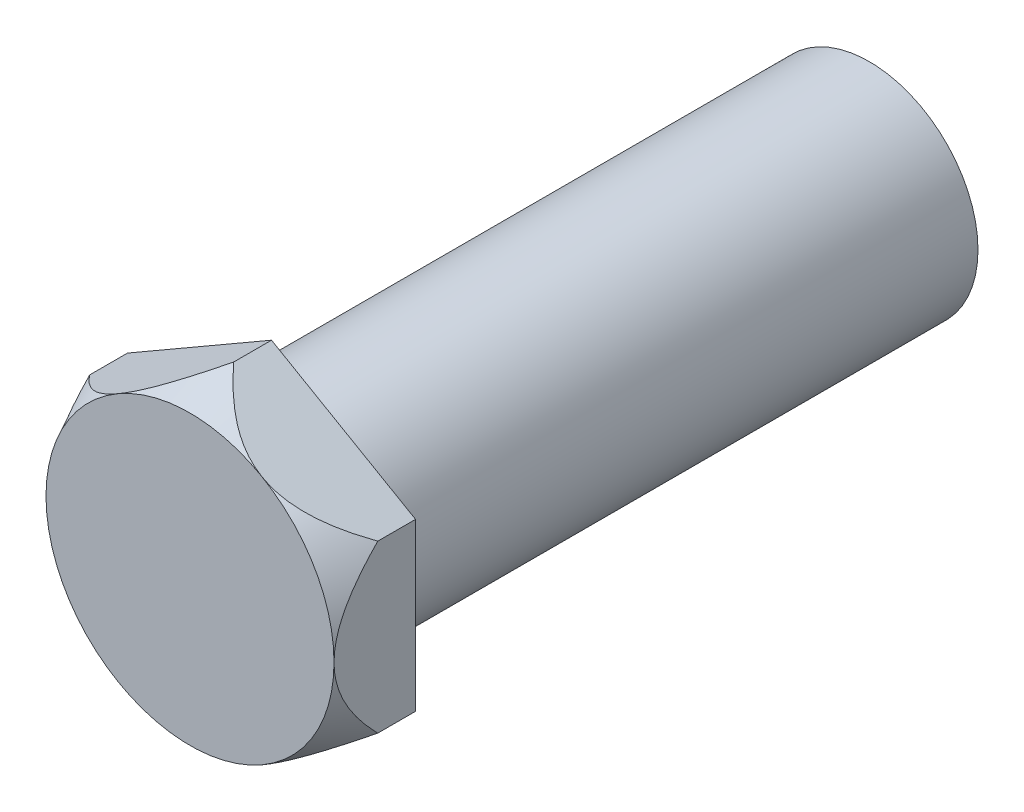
from build123d import *

# Parameters (mm, degrees)
BOSS_EXTRUDE1_DEPTH = 1.5
SKETCH2_OUTSIDE_W   = 14.364
SKETCH2_OUTSIDE_H   = 15.184
SKETCH2_OUTSIDE_R   = 2.65
CUT_EXTRUDE2_DEPTH  = 5.316924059
CUT_EXTRUDE2_DRAFT  = -27
SKETCH3_R           = 2
BOSS_EXTRUDE2_DEPTH = 11


with BuildPart() as part:
    # Sketch1 → Boss-Extrude1 (new body)
    with BuildSketch(Plane.XY):
        Polygon((0, 3.059956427), (-2.65, 1.529978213), (-2.65, -1.529978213), (0, -3.059956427), (2.65, -1.529978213), (2.65, 1.529978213), align=None)
    extrude(amount=BOSS_EXTRUDE1_DEPTH)


with BuildPart() as cut_extrude2_tool:
    # Sketch2 outside → Cut-Extrude2 (with draft: the straight prism first)
    with BuildSketch(Plane.XY.offset(1.5)):
        Rectangle(SKETCH2_OUTSIDE_W, SKETCH2_OUTSIDE_H)
        Circle(SKETCH2_OUTSIDE_R, mode=Mode.SUBTRACT)
    extrude(amount=-CUT_EXTRUDE2_DEPTH)
    # Cut-Extrude2: the draft: its side faces are tilted about the plane it starts from
    cut_extrude2_sides = [cut_extrude2_tool.faces().sort_by_distance(p)[0] for p in [
        (0, -7.592, -1.15846203),
        (7.182, 0, -1.15846203),
        (0, 7.592, -1.15846203),
        (-7.182, 0, -1.15846203),
        (-2.65, 0, -1.15846203),
    ]]
    draft(cut_extrude2_sides, Plane.XY.offset(1.5), CUT_EXTRUDE2_DRAFT)


with BuildPart() as part_1:
    add(part.part)

    # Cut-Extrude2: cut by cut_extrude2_tool
    add(cut_extrude2_tool.part, mode=Mode.SUBTRACT)

    # Sketch3 → Boss-Extrude2 (add)
    with BuildSketch(Plane(origin=(0, 0, 0), x_dir=(-1, 0, 0), z_dir=(0, 0, -1))):
        with Locations(Location((0, 0, 0), (0, 0, 180))):
            Circle(SKETCH3_R)
    extrude(amount=BOSS_EXTRUDE2_DEPTH)


solid = part_1.part
